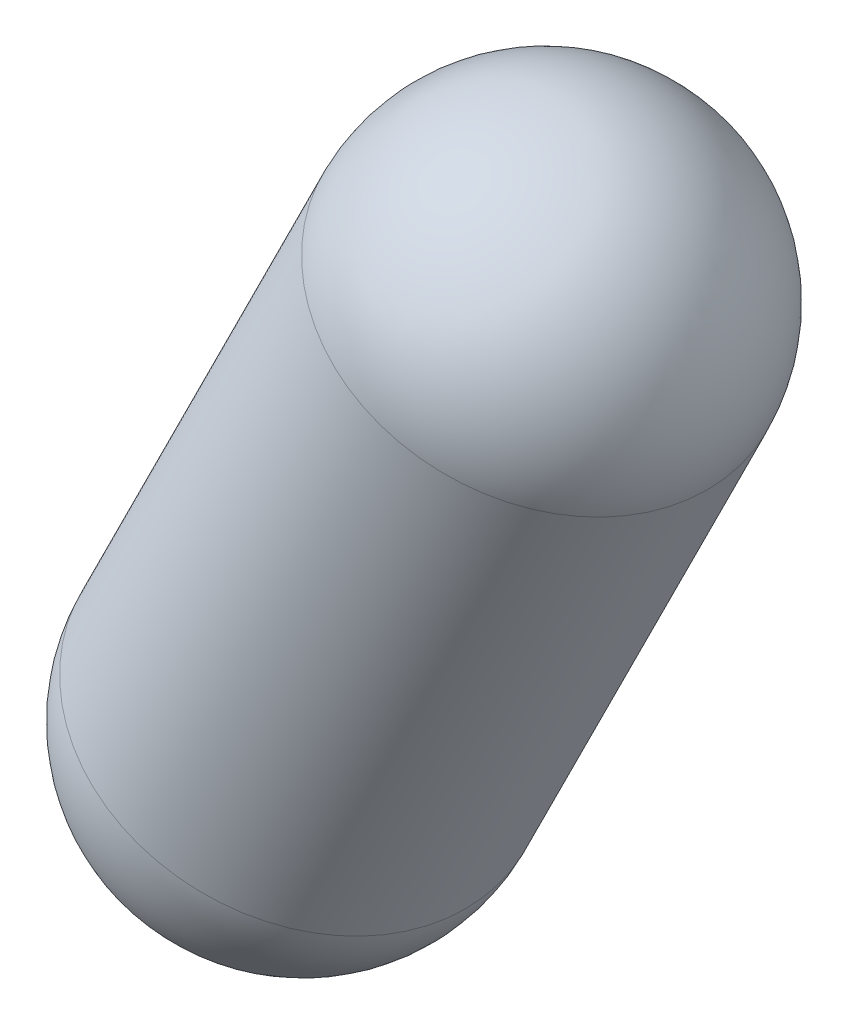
ISO-10303-21;
HEADER;
FILE_DESCRIPTION(('STEP AP214'),'2;1');
FILE_NAME('part.step','',(''),(''),'','','');
FILE_SCHEMA(('AUTOMOTIVE_DESIGN { 1 0 10303 214 1 1 1 1 }'));
ENDSEC;
DATA;
#1=APPLICATION_CONTEXT('core data for automotive mechanical design processes');
#2=APPLICATION_PROTOCOL_DEFINITION('international standard','automotive_design',2000,#1);
#3=PRODUCT_CONTEXT('',#1,'mechanical');
#4=PRODUCT('Part','Part','',(#3));
#5=PRODUCT_RELATED_PRODUCT_CATEGORY('part','',(#4));
#6=PRODUCT_DEFINITION_FORMATION('','',#4);
#7=PRODUCT_DEFINITION_CONTEXT('part definition',#1,'design');
#8=PRODUCT_DEFINITION('design','',#6,#7);
#9=PRODUCT_DEFINITION_SHAPE('','',#8);
#10=(LENGTH_UNIT() NAMED_UNIT(*) SI_UNIT(.MILLI.,.METRE.));
#11=(NAMED_UNIT(*) PLANE_ANGLE_UNIT() SI_UNIT($,.RADIAN.));
#12=(NAMED_UNIT(*) SI_UNIT($,.STERADIAN.) SOLID_ANGLE_UNIT());
#13=UNCERTAINTY_MEASURE_WITH_UNIT(LENGTH_MEASURE(1.E-05),#10,'distance_accuracy_value','');
#14=(GEOMETRIC_REPRESENTATION_CONTEXT(3) GLOBAL_UNCERTAINTY_ASSIGNED_CONTEXT((#13)) GLOBAL_UNIT_ASSIGNED_CONTEXT((#10,
#11,#12)) REPRESENTATION_CONTEXT('',''));
#15=CARTESIAN_POINT('',(0.,0.,0.));
#16=DIRECTION('',(0.,0.,1.));
#17=DIRECTION('',(1.,0.,0.));
#18=AXIS2_PLACEMENT_3D('',#15,#16,#17);
#19=CARTESIAN_POINT('',(-68.,-45.,0.));
#20=DIRECTION('',(0.447213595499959,0.894427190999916,0.));
#21=DIRECTION('',(0.,0.,-1.));
#22=AXIS2_PLACEMENT_3D('',#19,#20,#21);
#23=CYLINDRICAL_SURFACE('',#22,1.5);
#24=CARTESIAN_POINT('',(-66.,-41.,0.));
#25=DIRECTION('',(0.447213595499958,0.894427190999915,0.));
#26=DIRECTION('',(-0.894427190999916,0.447213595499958,0.));
#27=AXIS2_PLACEMENT_3D('',#24,#25,#26);
#28=CIRCLE('',#27,1.5);
#29=CARTESIAN_POINT('',(-66.,-41.,-1.5));
#30=VERTEX_POINT('',#29);
#31=CARTESIAN_POINT('',(-66.,-41.,1.5));
#32=VERTEX_POINT('',#31);
#33=EDGE_CURVE('E11',#30,#32,#28,.T.);
#34=ORIENTED_EDGE('',*,*,#33,.F.);
#35=CARTESIAN_POINT('',(-66.,-41.,0.));
#36=DIRECTION('',(-0.447213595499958,-0.894427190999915,0.));
#37=DIRECTION('',(0.894427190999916,-0.447213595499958,0.));
#38=AXIS2_PLACEMENT_3D('',#35,#36,#37);
#39=CIRCLE('',#38,1.5);
#40=EDGE_CURVE('E24',#30,#32,#39,.T.);
#41=ORIENTED_EDGE('',*,*,#40,.T.);
#42=EDGE_LOOP('',(#34,#41));
#43=FACE_BOUND('',#42,.T.);
#44=CARTESIAN_POINT('',(-68.,-45.,0.));
#45=DIRECTION('',(0.447213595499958,0.894427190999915,0.));
#46=DIRECTION('',(-0.894427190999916,0.447213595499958,0.));
#47=AXIS2_PLACEMENT_3D('',#44,#45,#46);
#48=CIRCLE('',#47,1.5);
#49=CARTESIAN_POINT('',(-68.,-45.,-1.5));
#50=VERTEX_POINT('',#49);
#51=CARTESIAN_POINT('',(-68.,-45.,1.5));
#52=VERTEX_POINT('',#51);
#53=EDGE_CURVE('E41',#50,#52,#48,.T.);
#54=ORIENTED_EDGE('',*,*,#53,.T.);
#55=CARTESIAN_POINT('',(-68.,-45.,0.));
#56=DIRECTION('',(-0.447213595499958,-0.894427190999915,0.));
#57=DIRECTION('',(0.894427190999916,-0.447213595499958,0.));
#58=AXIS2_PLACEMENT_3D('',#55,#56,#57);
#59=CIRCLE('',#58,1.5);
#60=EDGE_CURVE('E30',#50,#52,#59,.T.);
#61=ORIENTED_EDGE('',*,*,#60,.F.);
#62=EDGE_LOOP('',(#54,#61));
#63=FACE_BOUND('',#62,.T.);
#64=ADVANCED_FACE('F16',(#43,#63),#23,.T.);
#65=CARTESIAN_POINT('',(-66.,-41.,0.));
#66=DIRECTION('',(0.,0.,1.));
#67=DIRECTION('',(-0.894427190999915,0.447213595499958,0.));
#68=AXIS2_PLACEMENT_3D('',#65,#66,#67);
#69=SPHERICAL_SURFACE('',#68,1.5);
#70=CARTESIAN_POINT('',(-66.,-41.,0.));
#71=DIRECTION('',(0.447213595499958,0.894427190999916,0.));
#72=DIRECTION('',(-0.894427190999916,0.447213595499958,0.));
#73=AXIS2_PLACEMENT_3D('',#70,#71,#72);
#74=SPHERICAL_SURFACE('',#73,1.5);
#75=ORIENTED_EDGE('',*,*,#33,.T.);
#76=ORIENTED_EDGE('',*,*,#40,.F.);
#77=EDGE_LOOP('',(#75,#76));
#78=FACE_BOUND('',#77,.T.);
#79=ADVANCED_FACE('F62',(#78),#74,.T.);
#80=CARTESIAN_POINT('',(-68.,-45.,0.));
#81=DIRECTION('',(0.,0.,1.));
#82=DIRECTION('',(0.894427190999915,-0.447213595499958,0.));
#83=AXIS2_PLACEMENT_3D('',#80,#81,#82);
#84=SPHERICAL_SURFACE('',#83,1.5);
#85=CARTESIAN_POINT('',(-68.,-45.,0.));
#86=DIRECTION('',(-0.447213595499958,-0.894427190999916,0.));
#87=DIRECTION('',(0.894427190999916,-0.447213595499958,0.));
#88=AXIS2_PLACEMENT_3D('',#85,#86,#87);
#89=SPHERICAL_SURFACE('',#88,1.5);
#90=ORIENTED_EDGE('',*,*,#60,.T.);
#91=ORIENTED_EDGE('',*,*,#53,.F.);
#92=EDGE_LOOP('',(#90,#91));
#93=FACE_BOUND('',#92,.T.);
#94=ADVANCED_FACE('F44',(#93),#89,.T.);
#95=CLOSED_SHELL('',(#64,#79,#94));
#96=MANIFOLD_SOLID_BREP('B1',#95);
#97=ADVANCED_BREP_SHAPE_REPRESENTATION('',(#18,#96),#14);
#98=SHAPE_DEFINITION_REPRESENTATION(#9,#97);
ENDSEC;
END-ISO-10303-21;
